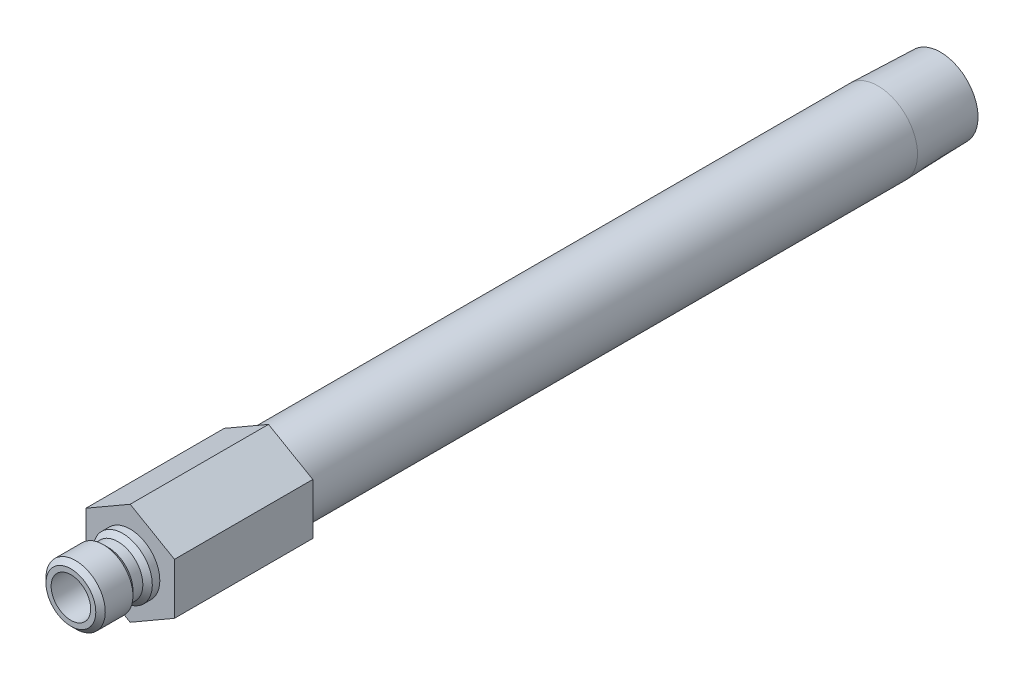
from build123d import *

# Parameters (mm, degrees)
SKETCH2_R           = 3.175
BOSS_EXTRUDE1_DEPTH = 22.225


with BuildPart() as part:
    # Sketch1 → Revolve1 (revolve)
    with BuildSketch(Plane(origin=(0, 0, 0), x_dir=(0, 0, -1), z_dir=(1, 0, 0))):
        Polygon((-9.525, 3.175), (-9.525, 4.0005), (-8.763, 4.7625), (-4.318, 4.7625), (-3.556, 4.0005), (-1.9685, 4.0005), (-1.2065, 4.7625), (0, 4.7625), (0, 6.35), (120.142, 6.35), (130.175, 6.036470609), (130.175, 4.6228), (22.225, 4.6228), (22.225, 3.175), align=None)
    revolve(axis=Axis((0, 0, 0), (0, 0, 1)))

    # Sketch2 → Boss-Extrude1 (add)
    with BuildSketch(Plane.XY):
        Polygon((-7.112, 4.106115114), (-7.112, -4.106115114), (0, -8.212230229), (7.112, -4.106115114), (7.112, 4.106115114), (0, 8.212230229), align=None)
        with Locations(Location((0, 0, 0), (0, 0, 90))):
            Circle(SKETCH2_R, mode=Mode.SUBTRACT)
    extrude(amount=-BOSS_EXTRUDE1_DEPTH)


solid = part.part
